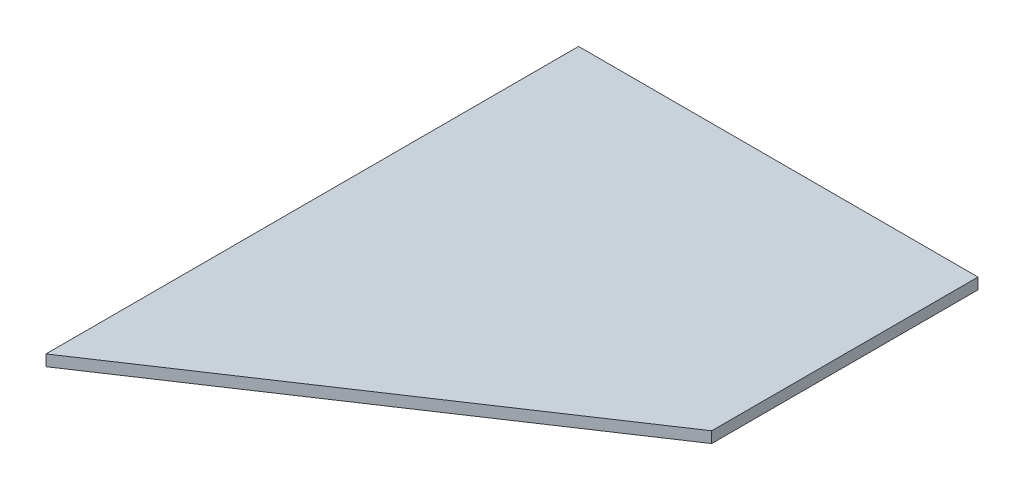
from build123d import *


with BuildPart() as part:
    # Sketch1 → Tapered_plywood_panel section 0
    with BuildSketch(Plane.YZ):
        with BuildLine():
            Line((-158.75, -152.4), (-152.4, -152.4))
            Line((-152.4, -152.4), (-152.4, 152.4))
            Line((-152.4, 152.4), (-158.75, 152.4))
            Line((-158.75, 152.4), (-158.75, -152.4))
        make_face()
    # Sketch2 → Tapered_plywood_panel section 1
    with BuildSketch(Plane.YZ.offset(304.8)):
        with BuildLine():
            Line((-82.55, -76.2), (-76.2, -76.2))
            Line((-76.2, -76.2), (-76.2, 76.2))
            Line((-76.2, 76.2), (-82.55, 76.2))
            Line((-82.55, 76.2), (-82.55, -76.2))
        make_face()
    loft()


solid = part.part
